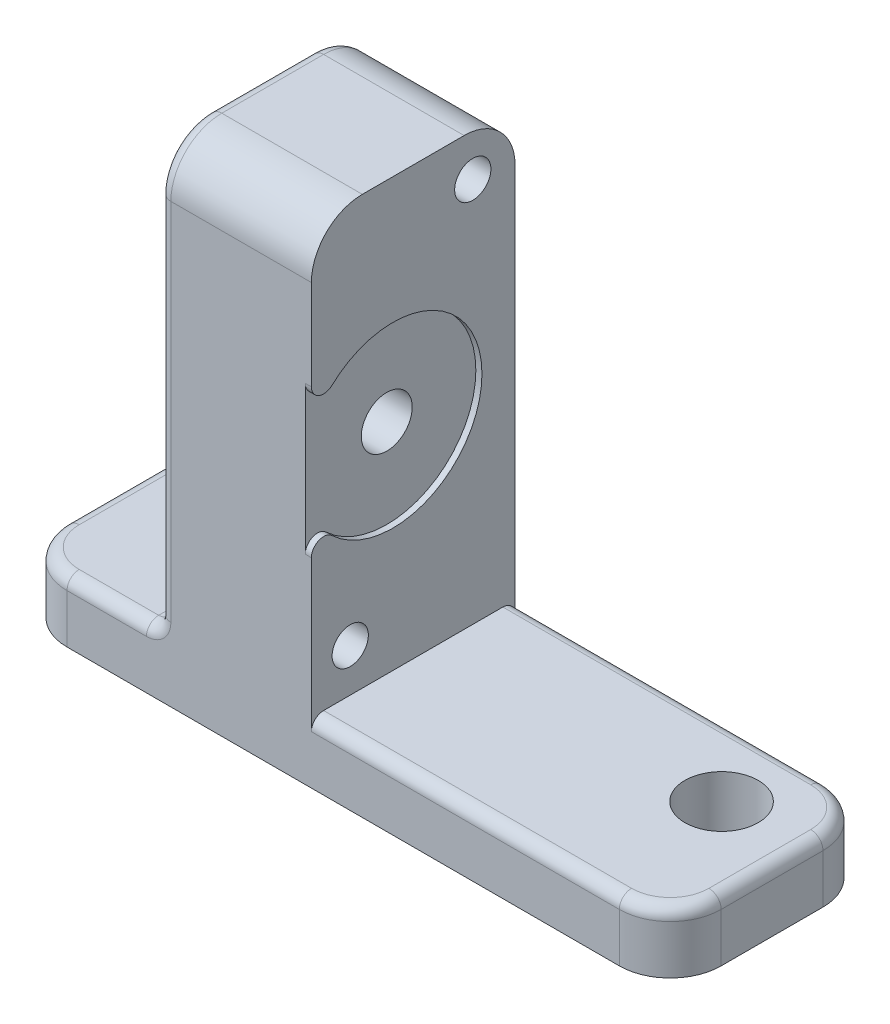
ISO-10303-21;
HEADER;
FILE_DESCRIPTION(('STEP AP214'),'2;1');
FILE_NAME('part.step','',(''),(''),'','','');
FILE_SCHEMA(('AUTOMOTIVE_DESIGN { 1 0 10303 214 1 1 1 1 }'));
ENDSEC;
DATA;
#1=APPLICATION_CONTEXT('core data for automotive mechanical design processes');
#2=APPLICATION_PROTOCOL_DEFINITION('international standard','automotive_design',2000,#1);
#3=PRODUCT_CONTEXT('',#1,'mechanical');
#4=PRODUCT('Part','Part','',(#3));
#5=PRODUCT_RELATED_PRODUCT_CATEGORY('part','',(#4));
#6=PRODUCT_DEFINITION_FORMATION('','',#4);
#7=PRODUCT_DEFINITION_CONTEXT('part definition',#1,'design');
#8=PRODUCT_DEFINITION('design','',#6,#7);
#9=PRODUCT_DEFINITION_SHAPE('','',#8);
#10=(LENGTH_UNIT() NAMED_UNIT(*) SI_UNIT(.MILLI.,.METRE.));
#11=(NAMED_UNIT(*) PLANE_ANGLE_UNIT() SI_UNIT($,.RADIAN.));
#12=(NAMED_UNIT(*) SI_UNIT($,.STERADIAN.) SOLID_ANGLE_UNIT());
#13=UNCERTAINTY_MEASURE_WITH_UNIT(LENGTH_MEASURE(1.E-05),#10,'distance_accuracy_value','');
#14=(GEOMETRIC_REPRESENTATION_CONTEXT(3) GLOBAL_UNCERTAINTY_ASSIGNED_CONTEXT((#13)) GLOBAL_UNIT_ASSIGNED_CONTEXT((#10,
#11,#12)) REPRESENTATION_CONTEXT('',''));
#15=CARTESIAN_POINT('',(0.,0.,0.));
#16=DIRECTION('',(0.,0.,1.));
#17=DIRECTION('',(1.,0.,0.));
#18=AXIS2_PLACEMENT_3D('',#15,#16,#17);
#19=CARTESIAN_POINT('',(-20.3962,3.81,-7.62));
#20=DIRECTION('',(-1.,0.,0.));
#21=DIRECTION('',(0.,0.,1.));
#22=AXIS2_PLACEMENT_3D('',#19,#20,#21);
#23=PLANE('',#22);
#24=DIRECTION('',(0.,-1.,0.));
#25=VECTOR('',#24,1.);
#26=CARTESIAN_POINT('',(-20.3962,3.81,1.905));
#27=LINE('',#26,#25);
#28=CARTESIAN_POINT('',(-20.3962,0.,1.905));
#29=VERTEX_POINT('',#28);
#30=CARTESIAN_POINT('',(-20.3962,3.048,1.905));
#31=VERTEX_POINT('',#30);
#32=EDGE_CURVE('E249',#29,#31,#27,.F.);
#33=ORIENTED_EDGE('',*,*,#32,.T.);
#34=DIRECTION('',(0.,0.,1.));
#35=VECTOR('',#34,1.);
#36=CARTESIAN_POINT('',(-20.3962,3.048,-7.62));
#37=LINE('',#36,#35);
#38=CARTESIAN_POINT('',(-20.3962,3.048,-4.445));
#39=VERTEX_POINT('',#38);
#40=EDGE_CURVE('E246',#31,#39,#37,.F.);
#41=ORIENTED_EDGE('',*,*,#40,.T.);
#42=DIRECTION('',(0.,-1.,0.));
#43=VECTOR('',#42,1.);
#44=CARTESIAN_POINT('',(-20.3962,0.,-4.445));
#45=LINE('',#44,#43);
#46=CARTESIAN_POINT('',(-20.3962,0.,-4.445));
#47=VERTEX_POINT('',#46);
#48=EDGE_CURVE('E239',#39,#47,#45,.T.);
#49=ORIENTED_EDGE('',*,*,#48,.T.);
#50=DIRECTION('',(0.,0.,1.));
#51=VECTOR('',#50,1.);
#52=CARTESIAN_POINT('',(-20.3962,0.,-7.62));
#53=LINE('',#52,#51);
#54=EDGE_CURVE('E243',#47,#29,#53,.T.);
#55=ORIENTED_EDGE('',*,*,#54,.T.);
#56=EDGE_LOOP('',(#33,#41,#49,#55));
#57=FACE_BOUND('',#56,.T.);
#58=ADVANCED_FACE('F50',(#57),#23,.T.);
#59=CARTESIAN_POINT('',(-11.5062,3.81,-7.62));
#60=DIRECTION('',(0.,1.,0.));
#61=DIRECTION('',(-1.,0.,0.));
#62=AXIS2_PLACEMENT_3D('',#59,#60,#61);
#63=PLANE('',#62);
#64=CARTESIAN_POINT('',(-17.2212,3.81,-4.445));
#65=DIRECTION('',(0.,1.,0.));
#66=DIRECTION('',(-1.,0.,0.));
#67=AXIS2_PLACEMENT_3D('',#64,#65,#66);
#68=CIRCLE('',#67,2.413);
#69=CARTESIAN_POINT('',(-17.2212,3.81,-6.858));
#70=VERTEX_POINT('',#69);
#71=CARTESIAN_POINT('',(-19.6342,3.81,-4.445));
#72=VERTEX_POINT('',#71);
#73=EDGE_CURVE('E325',#70,#72,#68,.T.);
#74=ORIENTED_EDGE('',*,*,#73,.T.);
#75=DIRECTION('',(0.,0.,1.));
#76=VECTOR('',#75,1.);
#77=CARTESIAN_POINT('',(-19.6342,3.81,-7.62));
#78=LINE('',#77,#76);
#79=CARTESIAN_POINT('',(-19.6342,3.81,1.905));
#80=VERTEX_POINT('',#79);
#81=EDGE_CURVE('E329',#72,#80,#78,.T.);
#82=ORIENTED_EDGE('',*,*,#81,.T.);
#83=CARTESIAN_POINT('',(-17.2212,3.81,1.905));
#84=DIRECTION('',(0.,1.,0.));
#85=DIRECTION('',(-1.,0.,0.));
#86=AXIS2_PLACEMENT_3D('',#83,#84,#85);
#87=CIRCLE('',#86,2.413);
#88=CARTESIAN_POINT('',(-17.2212,3.81,4.318));
#89=VERTEX_POINT('',#88);
#90=EDGE_CURVE('E327',#80,#89,#87,.T.);
#91=ORIENTED_EDGE('',*,*,#90,.T.);
#92=DIRECTION('',(-1.,0.,0.));
#93=VECTOR('',#92,1.);
#94=CARTESIAN_POINT('',(-11.5062,3.81,4.318));
#95=LINE('',#94,#93);
#96=CARTESIAN_POINT('',(-12.2682,3.81,4.318));
#97=VERTEX_POINT('',#96);
#98=EDGE_CURVE('E323',#89,#97,#95,.F.);
#99=ORIENTED_EDGE('',*,*,#98,.T.);
#100=DIRECTION('',(0.,0.,1.));
#101=VECTOR('',#100,1.);
#102=CARTESIAN_POINT('',(-12.2682,3.81,-7.62));
#103=LINE('',#102,#101);
#104=CARTESIAN_POINT('',(-12.2682,3.81,-6.858));
#105=VERTEX_POINT('',#104);
#106=EDGE_CURVE('E314',#97,#105,#103,.F.);
#107=ORIENTED_EDGE('',*,*,#106,.T.);
#108=DIRECTION('',(-1.,0.,0.));
#109=VECTOR('',#108,1.);
#110=CARTESIAN_POINT('',(-17.2212,3.81,-6.858));
#111=LINE('',#110,#109);
#112=EDGE_CURVE('E321',#105,#70,#111,.T.);
#113=ORIENTED_EDGE('',*,*,#112,.T.);
#114=EDGE_LOOP('',(#74,#82,#91,#99,#107,#113));
#115=FACE_BOUND('',#114,.T.);
#116=CARTESIAN_POINT('',(-15.9004,3.80999999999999,-3.175));
#117=DIRECTION('',(0.,1.,0.));
#118=DIRECTION('',(0.,0.,1.));
#119=AXIS2_PLACEMENT_3D('',#116,#117,#118);
#120=CIRCLE('',#119,2.286);
#121=CARTESIAN_POINT('',(-15.9004,3.80999999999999,-0.888999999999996));
#122=VERTEX_POINT('',#121);
#123=EDGE_CURVE('E525',#122,#122,#120,.T.);
#124=ORIENTED_EDGE('',*,*,#123,.F.);
#125=EDGE_LOOP('',(#124));
#126=FACE_BOUND('',#125,.T.);
#127=ADVANCED_FACE('F552',(#115,#126),#63,.T.);
#128=CARTESIAN_POINT('',(-11.5062,30.48,-7.62));
#129=DIRECTION('',(-1.,0.,0.));
#130=DIRECTION('',(0.,-1.,0.));
#131=AXIS2_PLACEMENT_3D('',#128,#129,#130);
#132=PLANE('',#131);
#133=DIRECTION('',(0.,0.,1.));
#134=VECTOR('',#133,1.);
#135=CARTESIAN_POINT('',(-11.5062,4.572,5.08));
#136=LINE('',#135,#134);
#137=CARTESIAN_POINT('',(-11.5062,4.572,-6.858));
#138=VERTEX_POINT('',#137);
#139=CARTESIAN_POINT('',(-11.5062,4.572,4.318));
#140=VERTEX_POINT('',#139);
#141=EDGE_CURVE('E380',#138,#140,#136,.T.);
#142=ORIENTED_EDGE('',*,*,#141,.T.);
#143=DIRECTION('',(0.,-1.,0.));
#144=VECTOR('',#143,1.);
#145=CARTESIAN_POINT('',(-11.5062,30.48,4.318));
#146=LINE('',#145,#144);
#147=CARTESIAN_POINT('',(-11.5062,27.305,4.318));
#148=VERTEX_POINT('',#147);
#149=EDGE_CURVE('E388',#140,#148,#146,.F.);
#150=ORIENTED_EDGE('',*,*,#149,.T.);
#151=CARTESIAN_POINT('',(-11.5062,27.305,1.905));
#152=DIRECTION('',(-1.,0.,0.));
#153=DIRECTION('',(0.,-1.,0.));
#154=AXIS2_PLACEMENT_3D('',#151,#152,#153);
#155=CIRCLE('',#154,2.413);
#156=CARTESIAN_POINT('',(-11.5062,29.718,1.905));
#157=VERTEX_POINT('',#156);
#158=EDGE_CURVE('E386',#148,#157,#155,.T.);
#159=ORIENTED_EDGE('',*,*,#158,.T.);
#160=DIRECTION('',(0.,0.,1.));
#161=VECTOR('',#160,1.);
#162=CARTESIAN_POINT('',(-11.5062,29.718,-7.62));
#163=LINE('',#162,#161);
#164=CARTESIAN_POINT('',(-11.5062,29.718,-4.445));
#165=VERTEX_POINT('',#164);
#166=EDGE_CURVE('E384',#157,#165,#163,.F.);
#167=ORIENTED_EDGE('',*,*,#166,.T.);
#168=CARTESIAN_POINT('',(-11.5062,27.305,-4.445));
#169=DIRECTION('',(-1.,0.,0.));
#170=DIRECTION('',(0.,-1.,0.));
#171=AXIS2_PLACEMENT_3D('',#168,#169,#170);
#172=CIRCLE('',#171,2.413);
#173=CARTESIAN_POINT('',(-11.5062,27.305,-6.858));
#174=VERTEX_POINT('',#173);
#175=EDGE_CURVE('E382',#165,#174,#172,.T.);
#176=ORIENTED_EDGE('',*,*,#175,.T.);
#177=DIRECTION('',(0.,-1.,0.));
#178=VECTOR('',#177,1.);
#179=CARTESIAN_POINT('',(-11.5062,3.81,-6.858));
#180=LINE('',#179,#178);
#181=EDGE_CURVE('E378',#174,#138,#180,.T.);
#182=ORIENTED_EDGE('',*,*,#181,.T.);
#183=EDGE_LOOP('',(#142,#150,#159,#167,#176,#182));
#184=FACE_BOUND('',#183,.T.);
#185=CARTESIAN_POINT('',(-11.5062,27.8438153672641,-4.98381536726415));
#186=DIRECTION('',(-1.,0.,0.));
#187=DIRECTION('',(0.,0.,1.));
#188=AXIS2_PLACEMENT_3D('',#185,#186,#187);
#189=CIRCLE('',#188,1.13029999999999);
#190=CARTESIAN_POINT('',(-11.5062,27.8438153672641,-3.85351536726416));
#191=VERTEX_POINT('',#190);
#192=EDGE_CURVE('E450',#191,#191,#189,.T.);
#193=ORIENTED_EDGE('',*,*,#192,.F.);
#194=EDGE_LOOP('',(#193));
#195=FACE_BOUND('',#194,.T.);
#196=CARTESIAN_POINT('',(-11.5062,6.48544664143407,2.65855335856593));
#197=DIRECTION('',(-1.,0.,0.));
#198=DIRECTION('',(0.,0.,1.));
#199=AXIS2_PLACEMENT_3D('',#196,#197,#198);
#200=CIRCLE('',#199,1.13029999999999);
#201=CARTESIAN_POINT('',(-11.5062,6.48544664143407,3.78885335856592));
#202=VERTEX_POINT('',#201);
#203=EDGE_CURVE('E319',#202,#202,#200,.T.);
#204=ORIENTED_EDGE('',*,*,#203,.F.);
#205=EDGE_LOOP('',(#204));
#206=FACE_BOUND('',#205,.T.);
#207=CARTESIAN_POINT('',(-11.5062,17.054916,0.));
#208=DIRECTION('',(-1.,0.,0.));
#209=DIRECTION('',(0.,0.,1.));
#210=AXIS2_PLACEMENT_3D('',#207,#208,#209);
#211=CIRCLE('',#210,1.13029999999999);
#212=CARTESIAN_POINT('',(-11.5062,17.054916,1.13029999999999));
#213=VERTEX_POINT('',#212);
#214=EDGE_CURVE('E318',#213,#213,#211,.T.);
#215=ORIENTED_EDGE('',*,*,#214,.F.);
#216=EDGE_LOOP('',(#215));
#217=FACE_BOUND('',#216,.T.);
#218=ADVANCED_FACE('F548',(#184,#195,#206,#217),#132,.T.);
#219=CARTESIAN_POINT('',(-1.9812,30.48,-7.62));
#220=DIRECTION('',(0.,1.,0.));
#221=DIRECTION('',(-1.,0.,0.));
#222=AXIS2_PLACEMENT_3D('',#219,#220,#221);
#223=PLANE('',#222);
#224=DIRECTION('',(-1.,0.,0.));
#225=VECTOR('',#224,1.);
#226=CARTESIAN_POINT('',(-11.5062,30.48,-4.445));
#227=LINE('',#226,#225);
#228=CARTESIAN_POINT('',(-1.9812,30.48,-4.445));
#229=VERTEX_POINT('',#228);
#230=CARTESIAN_POINT('',(-10.7442,30.48,-4.445));
#231=VERTEX_POINT('',#230);
#232=EDGE_CURVE('E306',#229,#231,#227,.T.);
#233=ORIENTED_EDGE('',*,*,#232,.T.);
#234=DIRECTION('',(0.,0.,1.));
#235=VECTOR('',#234,1.);
#236=CARTESIAN_POINT('',(-10.7442,30.48,-7.62));
#237=LINE('',#236,#235);
#238=CARTESIAN_POINT('',(-10.7442,30.48,1.905));
#239=VERTEX_POINT('',#238);
#240=EDGE_CURVE('E393',#231,#239,#237,.T.);
#241=ORIENTED_EDGE('',*,*,#240,.T.);
#242=DIRECTION('',(-1.,0.,0.));
#243=VECTOR('',#242,1.);
#244=CARTESIAN_POINT('',(-1.9812,30.48,1.905));
#245=LINE('',#244,#243);
#246=CARTESIAN_POINT('',(-1.9812,30.48,1.905));
#247=VERTEX_POINT('',#246);
#248=EDGE_CURVE('E304',#239,#247,#245,.F.);
#249=ORIENTED_EDGE('',*,*,#248,.T.);
#250=DIRECTION('',(0.,0.,1.));
#251=VECTOR('',#250,1.);
#252=CARTESIAN_POINT('',(-1.9812,30.48,-7.62));
#253=LINE('',#252,#251);
#254=EDGE_CURVE('E281',#229,#247,#253,.T.);
#255=ORIENTED_EDGE('',*,*,#254,.F.);
#256=EDGE_LOOP('',(#233,#241,#249,#255));
#257=FACE_BOUND('',#256,.T.);
#258=ADVANCED_FACE('F551',(#257),#223,.T.);
#259=CARTESIAN_POINT('',(-1.9812,3.81,-7.62));
#260=DIRECTION('',(1.,0.,0.));
#261=DIRECTION('',(0.,1.,0.));
#262=AXIS2_PLACEMENT_3D('',#259,#260,#261);
#263=PLANE('',#262);
#264=CARTESIAN_POINT('',(-1.9812,27.8438153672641,-4.98381536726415));
#265=DIRECTION('',(1.,0.,0.));
#266=DIRECTION('',(0.,1.,0.));
#267=AXIS2_PLACEMENT_3D('',#264,#265,#266);
#268=CIRCLE('',#267,1.13029999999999);
#269=CARTESIAN_POINT('',(-1.9812,28.9741153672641,-4.98381536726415));
#270=VERTEX_POINT('',#269);
#271=EDGE_CURVE('E540',#270,#270,#268,.T.);
#272=ORIENTED_EDGE('',*,*,#271,.F.);
#273=EDGE_LOOP('',(#272));
#274=FACE_BOUND('',#273,.T.);
#275=CARTESIAN_POINT('',(-1.9812,6.48544664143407,2.65855335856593));
#276=DIRECTION('',(1.,0.,0.));
#277=DIRECTION('',(0.,1.,0.));
#278=AXIS2_PLACEMENT_3D('',#275,#276,#277);
#279=CIRCLE('',#278,1.13029999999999);
#280=CARTESIAN_POINT('',(-1.9812,7.61574664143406,2.65855335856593));
#281=VERTEX_POINT('',#280);
#282=EDGE_CURVE('E315',#281,#281,#279,.T.);
#283=ORIENTED_EDGE('',*,*,#282,.F.);
#284=EDGE_LOOP('',(#283));
#285=FACE_BOUND('',#284,.T.);
#286=DIRECTION('',(0.,1.,0.));
#287=VECTOR('',#286,1.);
#288=CARTESIAN_POINT('',(-1.9812,3.81,5.08));
#289=LINE('',#288,#287);
#290=CARTESIAN_POINT('',(-1.9812,21.667416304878,5.08));
#291=VERTEX_POINT('',#290);
#292=CARTESIAN_POINT('',(-1.9812,27.305,5.08));
#293=VERTEX_POINT('',#292);
#294=EDGE_CURVE('E511',#291,#293,#289,.T.);
#295=ORIENTED_EDGE('',*,*,#294,.F.);
#296=CARTESIAN_POINT('',(-1.9812,21.667416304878,4.318));
#297=DIRECTION('',(1.,0.,0.));
#298=DIRECTION('',(0.,1.,0.));
#299=AXIS2_PLACEMENT_3D('',#296,#297,#298);
#300=CIRCLE('',#299,0.762);
#301=CARTESIAN_POINT('',(-1.9812,21.1111348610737,3.79723618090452));
#302=VERTEX_POINT('',#301);
#303=EDGE_CURVE('E404',#291,#302,#300,.T.);
#304=ORIENTED_EDGE('',*,*,#303,.T.);
#305=CARTESIAN_POINT('',(-1.9812,17.054916,0.));
#306=DIRECTION('',(1.,0.,0.));
#307=DIRECTION('',(0.,0.,-1.));
#308=AXIS2_PLACEMENT_3D('',#305,#306,#307);
#309=CIRCLE('',#308,5.55625);
#310=CARTESIAN_POINT('',(-1.9812,12.9986971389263,3.79723618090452));
#311=VERTEX_POINT('',#310);
#312=EDGE_CURVE('E529',#311,#302,#309,.T.);
#313=ORIENTED_EDGE('',*,*,#312,.F.);
#314=CARTESIAN_POINT('',(-1.9812,12.442415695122,4.318));
#315=DIRECTION('',(1.,0.,0.));
#316=DIRECTION('',(0.,1.,0.));
#317=AXIS2_PLACEMENT_3D('',#314,#315,#316);
#318=CIRCLE('',#317,0.762);
#319=CARTESIAN_POINT('',(-1.9812,12.442415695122,5.08));
#320=VERTEX_POINT('',#319);
#321=EDGE_CURVE('E402',#311,#320,#318,.T.);
#322=ORIENTED_EDGE('',*,*,#321,.T.);
#323=CARTESIAN_POINT('',(-1.9812,3.048,5.08));
#324=VERTEX_POINT('',#323);
#325=EDGE_CURVE('E476',#324,#320,#289,.T.);
#326=ORIENTED_EDGE('',*,*,#325,.F.);
#327=CARTESIAN_POINT('',(-1.9812,3.048,4.318));
#328=DIRECTION('',(1.,0.,0.));
#329=DIRECTION('',(0.,1.,0.));
#330=AXIS2_PLACEMENT_3D('',#327,#328,#329);
#331=CIRCLE('',#330,0.762);
#332=CARTESIAN_POINT('',(-1.9812,3.81,4.318));
#333=VERTEX_POINT('',#332);
#334=EDGE_CURVE('E13',#324,#333,#331,.F.);
#335=ORIENTED_EDGE('',*,*,#334,.T.);
#336=DIRECTION('',(0.,0.,1.));
#337=VECTOR('',#336,1.);
#338=CARTESIAN_POINT('',(-1.9812,3.81,-7.62));
#339=LINE('',#338,#337);
#340=CARTESIAN_POINT('',(-1.9812,3.81,-6.858));
#341=VERTEX_POINT('',#340);
#342=EDGE_CURVE('E269',#341,#333,#339,.T.);
#343=ORIENTED_EDGE('',*,*,#342,.F.);
#344=CARTESIAN_POINT('',(-1.9812,3.048,-6.858));
#345=DIRECTION('',(1.,0.,0.));
#346=DIRECTION('',(0.,1.,0.));
#347=AXIS2_PLACEMENT_3D('',#344,#345,#346);
#348=CIRCLE('',#347,0.762);
#349=CARTESIAN_POINT('',(-1.9812,3.048,-7.62));
#350=VERTEX_POINT('',#349);
#351=EDGE_CURVE('E406',#341,#350,#348,.F.);
#352=ORIENTED_EDGE('',*,*,#351,.T.);
#353=DIRECTION('',(0.,1.,0.));
#354=VECTOR('',#353,1.);
#355=CARTESIAN_POINT('',(-1.9812,3.81,-7.62));
#356=LINE('',#355,#354);
#357=CARTESIAN_POINT('',(-1.9812,27.305,-7.62));
#358=VERTEX_POINT('',#357);
#359=EDGE_CURVE('E266',#350,#358,#356,.T.);
#360=ORIENTED_EDGE('',*,*,#359,.T.);
#361=CARTESIAN_POINT('',(-1.9812,27.305,-4.445));
#362=DIRECTION('',(1.,0.,0.));
#363=DIRECTION('',(0.,1.,0.));
#364=AXIS2_PLACEMENT_3D('',#361,#362,#363);
#365=CIRCLE('',#364,3.175);
#366=EDGE_CURVE('E312',#358,#229,#365,.T.);
#367=ORIENTED_EDGE('',*,*,#366,.T.);
#368=ORIENTED_EDGE('',*,*,#254,.T.);
#369=CARTESIAN_POINT('',(-1.9812,27.305,1.905));
#370=DIRECTION('',(1.,0.,0.));
#371=DIRECTION('',(0.,1.,0.));
#372=AXIS2_PLACEMENT_3D('',#369,#370,#371);
#373=CIRCLE('',#372,3.175);
#374=EDGE_CURVE('E309',#247,#293,#373,.T.);
#375=ORIENTED_EDGE('',*,*,#374,.T.);
#376=EDGE_LOOP('',(#295,#304,#313,#322,#326,#335,#343,#352,#360,#367,#368,#375));
#377=FACE_BOUND('',#376,.T.);
#378=ADVANCED_FACE('F692',(#274,#285,#377),#263,.T.);
#379=CARTESIAN_POINT('',(20.3962,3.81,-7.62));
#380=DIRECTION('',(0.,1.,0.));
#381=DIRECTION('',(-1.,0.,0.));
#382=AXIS2_PLACEMENT_3D('',#379,#380,#381);
#383=PLANE('',#382);
#384=CARTESIAN_POINT('',(15.3416,3.81,-3.175));
#385=DIRECTION('',(0.,1.,0.));
#386=DIRECTION('',(0.,0.,1.));
#387=AXIS2_PLACEMENT_3D('',#384,#385,#386);
#388=CIRCLE('',#387,2.286);
#389=CARTESIAN_POINT('',(15.3416,3.81,-0.888999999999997));
#390=VERTEX_POINT('',#389);
#391=EDGE_CURVE('E519',#390,#390,#388,.T.);
#392=ORIENTED_EDGE('',*,*,#391,.F.);
#393=EDGE_LOOP('',(#392));
#394=FACE_BOUND('',#393,.T.);
#395=CARTESIAN_POINT('',(17.2212,3.81,-4.445));
#396=DIRECTION('',(0.,1.,0.));
#397=DIRECTION('',(-1.,0.,0.));
#398=AXIS2_PLACEMENT_3D('',#395,#396,#397);
#399=CIRCLE('',#398,2.413);
#400=CARTESIAN_POINT('',(19.6342,3.81,-4.445));
#401=VERTEX_POINT('',#400);
#402=CARTESIAN_POINT('',(17.2212,3.81,-6.858));
#403=VERTEX_POINT('',#402);
#404=EDGE_CURVE('E367',#401,#403,#399,.T.);
#405=ORIENTED_EDGE('',*,*,#404,.T.);
#406=DIRECTION('',(-1.,0.,0.));
#407=VECTOR('',#406,1.);
#408=CARTESIAN_POINT('',(-1.9812,3.81,-6.858));
#409=LINE('',#408,#407);
#410=EDGE_CURVE('E369',#403,#341,#409,.T.);
#411=ORIENTED_EDGE('',*,*,#410,.T.);
#412=ORIENTED_EDGE('',*,*,#342,.T.);
#413=DIRECTION('',(-1.,0.,0.));
#414=VECTOR('',#413,1.);
#415=CARTESIAN_POINT('',(20.3962,3.81,4.318));
#416=LINE('',#415,#414);
#417=CARTESIAN_POINT('',(17.2212,3.81,4.318));
#418=VERTEX_POINT('',#417);
#419=EDGE_CURVE('E361',#333,#418,#416,.F.);
#420=ORIENTED_EDGE('',*,*,#419,.T.);
#421=CARTESIAN_POINT('',(17.2212,3.81,1.905));
#422=DIRECTION('',(0.,1.,0.));
#423=DIRECTION('',(-1.,0.,0.));
#424=AXIS2_PLACEMENT_3D('',#421,#422,#423);
#425=CIRCLE('',#424,2.413);
#426=CARTESIAN_POINT('',(19.6342,3.81,1.905));
#427=VERTEX_POINT('',#426);
#428=EDGE_CURVE('E363',#418,#427,#425,.T.);
#429=ORIENTED_EDGE('',*,*,#428,.T.);
#430=DIRECTION('',(0.,0.,1.));
#431=VECTOR('',#430,1.);
#432=CARTESIAN_POINT('',(19.6342,3.81,-7.62));
#433=LINE('',#432,#431);
#434=EDGE_CURVE('E365',#427,#401,#433,.F.);
#435=ORIENTED_EDGE('',*,*,#434,.T.);
#436=EDGE_LOOP('',(#405,#411,#412,#420,#429,#435));
#437=FACE_BOUND('',#436,.T.);
#438=ADVANCED_FACE('F502',(#394,#437),#383,.T.);
#439=CARTESIAN_POINT('',(20.3962,3.81,-7.62));
#440=DIRECTION('',(1.,0.,0.));
#441=DIRECTION('',(0.,0.,-1.));
#442=AXIS2_PLACEMENT_3D('',#439,#440,#441);
#443=PLANE('',#442);
#444=DIRECTION('',(0.,1.,0.));
#445=VECTOR('',#444,1.);
#446=CARTESIAN_POINT('',(20.3962,3.81,-4.445));
#447=LINE('',#446,#445);
#448=CARTESIAN_POINT('',(20.3962,0.,-4.445));
#449=VERTEX_POINT('',#448);
#450=CARTESIAN_POINT('',(20.3962,3.048,-4.445));
#451=VERTEX_POINT('',#450);
#452=EDGE_CURVE('E293',#449,#451,#447,.T.);
#453=ORIENTED_EDGE('',*,*,#452,.T.);
#454=DIRECTION('',(0.,0.,1.));
#455=VECTOR('',#454,1.);
#456=CARTESIAN_POINT('',(20.3962,3.048,-7.62));
#457=LINE('',#456,#455);
#458=CARTESIAN_POINT('',(20.3962,3.048,1.905));
#459=VERTEX_POINT('',#458);
#460=EDGE_CURVE('E374',#451,#459,#457,.T.);
#461=ORIENTED_EDGE('',*,*,#460,.T.);
#462=DIRECTION('',(0.,1.,0.));
#463=VECTOR('',#462,1.);
#464=CARTESIAN_POINT('',(20.3962,3.81,1.905));
#465=LINE('',#464,#463);
#466=CARTESIAN_POINT('',(20.3962,0.,1.905));
#467=VERTEX_POINT('',#466);
#468=EDGE_CURVE('E291',#459,#467,#465,.F.);
#469=ORIENTED_EDGE('',*,*,#468,.T.);
#470=DIRECTION('',(0.,0.,1.));
#471=VECTOR('',#470,1.);
#472=CARTESIAN_POINT('',(20.3962,0.,-7.62));
#473=LINE('',#472,#471);
#474=EDGE_CURVE('E265',#449,#467,#473,.T.);
#475=ORIENTED_EDGE('',*,*,#474,.F.);
#476=EDGE_LOOP('',(#453,#461,#469,#475));
#477=FACE_BOUND('',#476,.T.);
#478=ADVANCED_FACE('F487',(#477),#443,.T.);
#479=CARTESIAN_POINT('',(-20.3962,0.,-7.62));
#480=DIRECTION('',(0.,-1.,0.));
#481=DIRECTION('',(0.,0.,-1.));
#482=AXIS2_PLACEMENT_3D('',#479,#480,#481);
#483=PLANE('',#482);
#484=CARTESIAN_POINT('',(-15.9004,0.,-3.175));
#485=DIRECTION('',(0.,1.,0.));
#486=DIRECTION('',(0.,0.,1.));
#487=AXIS2_PLACEMENT_3D('',#484,#485,#486);
#488=CIRCLE('',#487,2.286);
#489=CARTESIAN_POINT('',(-15.9004,0.,-0.888999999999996));
#490=VERTEX_POINT('',#489);
#491=EDGE_CURVE('E522',#490,#490,#488,.T.);
#492=ORIENTED_EDGE('',*,*,#491,.T.);
#493=EDGE_LOOP('',(#492));
#494=FACE_BOUND('',#493,.T.);
#495=CARTESIAN_POINT('',(15.3416,0.,-3.175));
#496=DIRECTION('',(0.,1.,0.));
#497=DIRECTION('',(0.,0.,1.));
#498=AXIS2_PLACEMENT_3D('',#495,#496,#497);
#499=CIRCLE('',#498,2.286);
#500=CARTESIAN_POINT('',(15.3416,0.,-0.888999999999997));
#501=VERTEX_POINT('',#500);
#502=EDGE_CURVE('E516',#501,#501,#499,.T.);
#503=ORIENTED_EDGE('',*,*,#502,.T.);
#504=EDGE_LOOP('',(#503));
#505=FACE_BOUND('',#504,.T.);
#506=ORIENTED_EDGE('',*,*,#54,.F.);
#507=CARTESIAN_POINT('',(-17.2212,0.,-4.445));
#508=DIRECTION('',(0.,-1.,0.));
#509=DIRECTION('',(0.,0.,-1.));
#510=AXIS2_PLACEMENT_3D('',#507,#508,#509);
#511=CIRCLE('',#510,3.175);
#512=CARTESIAN_POINT('',(-17.2212,0.,-7.62));
#513=VERTEX_POINT('',#512);
#514=EDGE_CURVE('E252',#47,#513,#511,.T.);
#515=ORIENTED_EDGE('',*,*,#514,.T.);
#516=DIRECTION('',(1.,0.,0.));
#517=VECTOR('',#516,1.);
#518=CARTESIAN_POINT('',(-20.3962,0.,-7.62));
#519=LINE('',#518,#517);
#520=CARTESIAN_POINT('',(17.2212,0.,-7.62));
#521=VERTEX_POINT('',#520);
#522=EDGE_CURVE('E272',#513,#521,#519,.T.);
#523=ORIENTED_EDGE('',*,*,#522,.T.);
#524=CARTESIAN_POINT('',(17.2212,0.,-4.445));
#525=DIRECTION('',(0.,-1.,0.));
#526=DIRECTION('',(0.,0.,-1.));
#527=AXIS2_PLACEMENT_3D('',#524,#525,#526);
#528=CIRCLE('',#527,3.175);
#529=EDGE_CURVE('E260',#521,#449,#528,.T.);
#530=ORIENTED_EDGE('',*,*,#529,.T.);
#531=ORIENTED_EDGE('',*,*,#474,.T.);
#532=CARTESIAN_POINT('',(17.2212,0.,1.905));
#533=DIRECTION('',(0.,-1.,0.));
#534=DIRECTION('',(0.,0.,-1.));
#535=AXIS2_PLACEMENT_3D('',#532,#533,#534);
#536=CIRCLE('',#535,3.175);
#537=CARTESIAN_POINT('',(17.2212,0.,5.08));
#538=VERTEX_POINT('',#537);
#539=EDGE_CURVE('E284',#467,#538,#536,.T.);
#540=ORIENTED_EDGE('',*,*,#539,.T.);
#541=DIRECTION('',(1.,0.,0.));
#542=VECTOR('',#541,1.);
#543=CARTESIAN_POINT('',(-20.3962,0.,5.08));
#544=LINE('',#543,#542);
#545=CARTESIAN_POINT('',(-17.2212,0.,5.08));
#546=VERTEX_POINT('',#545);
#547=EDGE_CURVE('E480',#546,#538,#544,.T.);
#548=ORIENTED_EDGE('',*,*,#547,.F.);
#549=CARTESIAN_POINT('',(-17.2212,0.,1.905));
#550=DIRECTION('',(0.,-1.,0.));
#551=DIRECTION('',(0.,0.,-1.));
#552=AXIS2_PLACEMENT_3D('',#549,#550,#551);
#553=CIRCLE('',#552,3.175);
#554=EDGE_CURVE('E248',#546,#29,#553,.T.);
#555=ORIENTED_EDGE('',*,*,#554,.T.);
#556=EDGE_LOOP('',(#506,#515,#523,#530,#531,#540,#548,#555));
#557=FACE_BOUND('',#556,.T.);
#558=ADVANCED_FACE('F262',(#494,#505,#557),#483,.T.);
#559=CARTESIAN_POINT('',(0.,0.,-7.62));
#560=DIRECTION('',(0.,0.,1.));
#561=DIRECTION('',(1.,0.,0.));
#562=AXIS2_PLACEMENT_3D('',#559,#560,#561);
#563=PLANE('',#562);
#564=ORIENTED_EDGE('',*,*,#359,.F.);
#565=DIRECTION('',(-1.,0.,0.));
#566=VECTOR('',#565,1.);
#567=CARTESIAN_POINT('',(17.2212,3.048,-7.62));
#568=LINE('',#567,#566);
#569=CARTESIAN_POINT('',(17.2212,3.048,-7.62));
#570=VERTEX_POINT('',#569);
#571=EDGE_CURVE('E359',#350,#570,#568,.F.);
#572=ORIENTED_EDGE('',*,*,#571,.T.);
#573=DIRECTION('',(0.,1.,0.));
#574=VECTOR('',#573,1.);
#575=CARTESIAN_POINT('',(17.2212,0.,-7.62));
#576=LINE('',#575,#574);
#577=EDGE_CURVE('E288',#570,#521,#576,.F.);
#578=ORIENTED_EDGE('',*,*,#577,.T.);
#579=ORIENTED_EDGE('',*,*,#522,.F.);
#580=DIRECTION('',(0.,-1.,0.));
#581=VECTOR('',#580,1.);
#582=CARTESIAN_POINT('',(-17.2212,3.81,-7.62));
#583=LINE('',#582,#581);
#584=CARTESIAN_POINT('',(-17.2212,3.048,-7.62));
#585=VERTEX_POINT('',#584);
#586=EDGE_CURVE('E255',#513,#585,#583,.F.);
#587=ORIENTED_EDGE('',*,*,#586,.T.);
#588=DIRECTION('',(-1.,0.,0.));
#589=VECTOR('',#588,1.);
#590=CARTESIAN_POINT('',(-11.5062,3.048,-7.62));
#591=LINE('',#590,#589);
#592=CARTESIAN_POINT('',(-12.2682,3.048,-7.62));
#593=VERTEX_POINT('',#592);
#594=EDGE_CURVE('E357',#585,#593,#591,.F.);
#595=ORIENTED_EDGE('',*,*,#594,.T.);
#596=CARTESIAN_POINT('',(-12.2682,4.572,-7.62));
#597=DIRECTION('',(0.,0.,1.));
#598=DIRECTION('',(1.,0.,0.));
#599=AXIS2_PLACEMENT_3D('',#596,#597,#598);
#600=CIRCLE('',#599,1.524);
#601=CARTESIAN_POINT('',(-10.7442,4.572,-7.62));
#602=VERTEX_POINT('',#601);
#603=EDGE_CURVE('E354',#602,#593,#600,.F.);
#604=ORIENTED_EDGE('',*,*,#603,.F.);
#605=DIRECTION('',(0.,-1.,0.));
#606=VECTOR('',#605,1.);
#607=CARTESIAN_POINT('',(-10.7442,27.305,-7.62));
#608=LINE('',#607,#606);
#609=CARTESIAN_POINT('',(-10.7442,27.305,-7.62));
#610=VERTEX_POINT('',#609);
#611=EDGE_CURVE('E352',#602,#610,#608,.F.);
#612=ORIENTED_EDGE('',*,*,#611,.T.);
#613=DIRECTION('',(-1.,0.,0.));
#614=VECTOR('',#613,1.);
#615=CARTESIAN_POINT('',(-1.9812,27.305,-7.62));
#616=LINE('',#615,#614);
#617=EDGE_CURVE('E259',#610,#358,#616,.F.);
#618=ORIENTED_EDGE('',*,*,#617,.T.);
#619=EDGE_LOOP('',(#564,#572,#578,#579,#587,#595,#604,#612,#618));
#620=FACE_BOUND('',#619,.T.);
#621=ADVANCED_FACE('F721',(#620),#563,.F.);
#622=CARTESIAN_POINT('',(0.,0.,5.08));
#623=DIRECTION('',(0.,0.,1.));
#624=DIRECTION('',(1.,0.,0.));
#625=AXIS2_PLACEMENT_3D('',#622,#623,#624);
#626=PLANE('',#625);
#627=CARTESIAN_POINT('',(-12.2682,4.572,5.08));
#628=DIRECTION('',(0.,0.,1.));
#629=DIRECTION('',(1.,0.,0.));
#630=AXIS2_PLACEMENT_3D('',#627,#628,#629);
#631=CIRCLE('',#630,1.524);
#632=CARTESIAN_POINT('',(-12.2682,3.048,5.08));
#633=VERTEX_POINT('',#632);
#634=CARTESIAN_POINT('',(-10.7442,4.572,5.08));
#635=VERTEX_POINT('',#634);
#636=EDGE_CURVE('E345',#633,#635,#631,.T.);
#637=ORIENTED_EDGE('',*,*,#636,.F.);
#638=DIRECTION('',(-1.,0.,0.));
#639=VECTOR('',#638,1.);
#640=CARTESIAN_POINT('',(0.,3.048,5.08));
#641=LINE('',#640,#639);
#642=CARTESIAN_POINT('',(-17.2212,3.048,5.08));
#643=VERTEX_POINT('',#642);
#644=EDGE_CURVE('E350',#633,#643,#641,.T.);
#645=ORIENTED_EDGE('',*,*,#644,.T.);
#646=DIRECTION('',(0.,-1.,0.));
#647=VECTOR('',#646,1.);
#648=CARTESIAN_POINT('',(-17.2212,0.,5.08));
#649=LINE('',#648,#647);
#650=EDGE_CURVE('E299',#643,#546,#649,.T.);
#651=ORIENTED_EDGE('',*,*,#650,.T.);
#652=ORIENTED_EDGE('',*,*,#547,.T.);
#653=DIRECTION('',(0.,1.,0.));
#654=VECTOR('',#653,1.);
#655=CARTESIAN_POINT('',(17.2212,0.,5.08));
#656=LINE('',#655,#654);
#657=CARTESIAN_POINT('',(17.2212,3.048,5.08));
#658=VERTEX_POINT('',#657);
#659=EDGE_CURVE('E301',#538,#658,#656,.T.);
#660=ORIENTED_EDGE('',*,*,#659,.T.);
#661=DIRECTION('',(-1.,0.,0.));
#662=VECTOR('',#661,1.);
#663=CARTESIAN_POINT('',(0.,3.048,5.08));
#664=LINE('',#663,#662);
#665=EDGE_CURVE('E337',#658,#324,#664,.T.);
#666=ORIENTED_EDGE('',*,*,#665,.T.);
#667=ORIENTED_EDGE('',*,*,#325,.T.);
#668=DIRECTION('',(-1.,0.,0.));
#669=VECTOR('',#668,1.);
#670=CARTESIAN_POINT('',(-2.3622,12.442415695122,5.08));
#671=LINE('',#670,#669);
#672=CARTESIAN_POINT('',(-2.3622,12.442415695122,5.08));
#673=VERTEX_POINT('',#672);
#674=EDGE_CURVE('E340',#320,#673,#671,.T.);
#675=ORIENTED_EDGE('',*,*,#674,.T.);
#676=DIRECTION('',(0.,1.,0.));
#677=VECTOR('',#676,1.);
#678=CARTESIAN_POINT('',(-2.3622,0.,5.08));
#679=LINE('',#678,#677);
#680=CARTESIAN_POINT('',(-2.3622,21.667416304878,5.08));
#681=VERTEX_POINT('',#680);
#682=EDGE_CURVE('E279',#673,#681,#679,.T.);
#683=ORIENTED_EDGE('',*,*,#682,.T.);
#684=DIRECTION('',(-1.,0.,0.));
#685=VECTOR('',#684,1.);
#686=CARTESIAN_POINT('',(-1.9812,21.667416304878,5.08));
#687=LINE('',#686,#685);
#688=EDGE_CURVE('E343',#681,#291,#687,.F.);
#689=ORIENTED_EDGE('',*,*,#688,.T.);
#690=ORIENTED_EDGE('',*,*,#294,.T.);
#691=DIRECTION('',(-1.,0.,0.));
#692=VECTOR('',#691,1.);
#693=CARTESIAN_POINT('',(0.,27.305,5.08));
#694=LINE('',#693,#692);
#695=CARTESIAN_POINT('',(-10.7442,27.305,5.08));
#696=VERTEX_POINT('',#695);
#697=EDGE_CURVE('E296',#293,#696,#694,.T.);
#698=ORIENTED_EDGE('',*,*,#697,.T.);
#699=DIRECTION('',(0.,-1.,0.));
#700=VECTOR('',#699,1.);
#701=CARTESIAN_POINT('',(-10.7442,0.,5.08));
#702=LINE('',#701,#700);
#703=EDGE_CURVE('E348',#696,#635,#702,.T.);
#704=ORIENTED_EDGE('',*,*,#703,.T.);
#705=EDGE_LOOP('',(#637,#645,#651,#652,#660,#666,#667,#675,#683,#689,#690,#698,#704));
#706=FACE_BOUND('',#705,.T.);
#707=ADVANCED_FACE('F475',(#706),#626,.T.);
#708=CARTESIAN_POINT('',(15.3416,3.81,-3.175));
#709=DIRECTION('',(0.,1.,0.));
#710=DIRECTION('',(0.,0.,1.));
#711=AXIS2_PLACEMENT_3D('',#708,#709,#710);
#712=CYLINDRICAL_SURFACE('',#711,2.286);
#713=ORIENTED_EDGE('',*,*,#502,.F.);
#714=EDGE_LOOP('',(#713));
#715=FACE_BOUND('',#714,.T.);
#716=ORIENTED_EDGE('',*,*,#391,.T.);
#717=EDGE_LOOP('',(#716));
#718=FACE_BOUND('',#717,.T.);
#719=ADVANCED_FACE('F590',(#715,#718),#712,.F.);
#720=CARTESIAN_POINT('',(-15.9004,3.80999999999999,-3.175));
#721=DIRECTION('',(0.,1.,0.));
#722=DIRECTION('',(0.,0.,1.));
#723=AXIS2_PLACEMENT_3D('',#720,#721,#722);
#724=CYLINDRICAL_SURFACE('',#723,2.286);
#725=ORIENTED_EDGE('',*,*,#491,.F.);
#726=EDGE_LOOP('',(#725));
#727=FACE_BOUND('',#726,.T.);
#728=ORIENTED_EDGE('',*,*,#123,.T.);
#729=EDGE_LOOP('',(#728));
#730=FACE_BOUND('',#729,.T.);
#731=ADVANCED_FACE('F582',(#727,#730),#724,.F.);
#732=CARTESIAN_POINT('',(-2.3622,17.054916,0.));
#733=DIRECTION('',(1.,0.,0.));
#734=DIRECTION('',(0.,0.,-1.));
#735=AXIS2_PLACEMENT_3D('',#732,#733,#734);
#736=PLANE('',#735);
#737=ORIENTED_EDGE('',*,*,#682,.F.);
#738=CARTESIAN_POINT('',(-2.3622,12.442415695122,4.318));
#739=DIRECTION('',(1.,0.,0.));
#740=DIRECTION('',(0.,0.,-1.));
#741=AXIS2_PLACEMENT_3D('',#738,#739,#740);
#742=CIRCLE('',#741,0.762);
#743=CARTESIAN_POINT('',(-2.3622,12.9986971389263,3.79723618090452));
#744=VERTEX_POINT('',#743);
#745=EDGE_CURVE('E59',#673,#744,#742,.F.);
#746=ORIENTED_EDGE('',*,*,#745,.T.);
#747=CARTESIAN_POINT('',(-2.3622,17.054916,0.));
#748=DIRECTION('',(1.,0.,0.));
#749=DIRECTION('',(0.,0.,-1.));
#750=AXIS2_PLACEMENT_3D('',#747,#748,#749);
#751=CIRCLE('',#750,5.55625);
#752=CARTESIAN_POINT('',(-2.3622,21.1111348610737,3.79723618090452));
#753=VERTEX_POINT('',#752);
#754=EDGE_CURVE('E280',#744,#753,#751,.T.);
#755=ORIENTED_EDGE('',*,*,#754,.T.);
#756=CARTESIAN_POINT('',(-2.3622,21.667416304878,4.318));
#757=DIRECTION('',(1.,0.,0.));
#758=DIRECTION('',(0.,0.,-1.));
#759=AXIS2_PLACEMENT_3D('',#756,#757,#758);
#760=CIRCLE('',#759,0.762);
#761=EDGE_CURVE('E67',#753,#681,#760,.F.);
#762=ORIENTED_EDGE('',*,*,#761,.T.);
#763=EDGE_LOOP('',(#737,#746,#755,#762));
#764=FACE_BOUND('',#763,.T.);
#765=CARTESIAN_POINT('',(-2.3622,17.054916,0.));
#766=DIRECTION('',(1.,0.,0.));
#767=DIRECTION('',(0.,0.,-1.));
#768=AXIS2_PLACEMENT_3D('',#765,#766,#767);
#769=CIRCLE('',#768,1.5875);
#770=CARTESIAN_POINT('',(-2.3622,17.054916,-1.5875));
#771=VERTEX_POINT('',#770);
#772=EDGE_CURVE('E276',#771,#771,#769,.F.);
#773=ORIENTED_EDGE('',*,*,#772,.T.);
#774=EDGE_LOOP('',(#773));
#775=FACE_BOUND('',#774,.T.);
#776=ADVANCED_FACE('F580',(#764,#775),#736,.T.);
#777=CARTESIAN_POINT('',(-2.3622,17.054916,0.));
#778=DIRECTION('',(1.,0.,0.));
#779=DIRECTION('',(0.,0.,-1.));
#780=AXIS2_PLACEMENT_3D('',#777,#778,#779);
#781=CYLINDRICAL_SURFACE('',#780,5.55625);
#782=ORIENTED_EDGE('',*,*,#312,.T.);
#783=DIRECTION('',(1.,0.,0.));
#784=VECTOR('',#783,1.);
#785=CARTESIAN_POINT('',(-2.3622,21.1111348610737,3.79723618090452));
#786=LINE('',#785,#784);
#787=EDGE_CURVE('E400',#302,#753,#786,.F.);
#788=ORIENTED_EDGE('',*,*,#787,.T.);
#789=ORIENTED_EDGE('',*,*,#754,.F.);
#790=DIRECTION('',(1.,0.,0.));
#791=VECTOR('',#790,1.);
#792=CARTESIAN_POINT('',(-2.3622,12.9986971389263,3.79723618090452));
#793=LINE('',#792,#791);
#794=EDGE_CURVE('E397',#744,#311,#793,.T.);
#795=ORIENTED_EDGE('',*,*,#794,.T.);
#796=EDGE_LOOP('',(#782,#788,#789,#795));
#797=FACE_BOUND('',#796,.T.);
#798=ADVANCED_FACE('F571',(#797),#781,.F.);
#799=CARTESIAN_POINT('',(-7.6962,17.054916,0.));
#800=DIRECTION('',(-1.,0.,0.));
#801=DIRECTION('',(0.,0.,1.));
#802=AXIS2_PLACEMENT_3D('',#799,#800,#801);
#803=PLANE('',#802);
#804=CARTESIAN_POINT('',(-7.6962,17.054916,0.));
#805=DIRECTION('',(-1.,0.,0.));
#806=DIRECTION('',(0.,0.,1.));
#807=AXIS2_PLACEMENT_3D('',#804,#805,#806);
#808=CIRCLE('',#807,1.13029999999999);
#809=CARTESIAN_POINT('',(-7.6962,17.054916,1.13029999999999));
#810=VERTEX_POINT('',#809);
#811=EDGE_CURVE('E532',#810,#810,#808,.T.);
#812=ORIENTED_EDGE('',*,*,#811,.T.);
#813=EDGE_LOOP('',(#812));
#814=FACE_BOUND('',#813,.T.);
#815=CARTESIAN_POINT('',(-7.6962,17.054916,0.));
#816=DIRECTION('',(1.,0.,0.));
#817=DIRECTION('',(0.,0.,-1.));
#818=AXIS2_PLACEMENT_3D('',#815,#816,#817);
#819=CIRCLE('',#818,1.5875);
#820=CARTESIAN_POINT('',(-7.6962,17.054916,-1.5875));
#821=VERTEX_POINT('',#820);
#822=EDGE_CURVE('E513',#821,#821,#819,.T.);
#823=ORIENTED_EDGE('',*,*,#822,.T.);
#824=EDGE_LOOP('',(#823));
#825=FACE_BOUND('',#824,.T.);
#826=ADVANCED_FACE('F567',(#814,#825),#803,.F.);
#827=CARTESIAN_POINT('',(-1.9812,17.054916,0.));
#828=DIRECTION('',(1.,0.,0.));
#829=DIRECTION('',(0.,0.,-1.));
#830=AXIS2_PLACEMENT_3D('',#827,#828,#829);
#831=CYLINDRICAL_SURFACE('',#830,1.5875);
#832=ORIENTED_EDGE('',*,*,#822,.F.);
#833=EDGE_LOOP('',(#832));
#834=FACE_BOUND('',#833,.T.);
#835=ORIENTED_EDGE('',*,*,#772,.F.);
#836=EDGE_LOOP('',(#835));
#837=FACE_BOUND('',#836,.T.);
#838=ADVANCED_FACE('F570',(#834,#837),#831,.F.);
#839=CARTESIAN_POINT('',(-17.2212,3.81,-4.445));
#840=DIRECTION('',(0.,1.,0.));
#841=DIRECTION('',(0.,0.,1.));
#842=AXIS2_PLACEMENT_3D('',#839,#840,#841);
#843=CYLINDRICAL_SURFACE('',#842,3.175);
#844=ORIENTED_EDGE('',*,*,#48,.F.);
#845=CARTESIAN_POINT('',(-17.2212,3.048,-4.445));
#846=DIRECTION('',(0.,1.,0.));
#847=DIRECTION('',(-1.,0.,0.));
#848=AXIS2_PLACEMENT_3D('',#845,#846,#847);
#849=CIRCLE('',#848,3.175);
#850=EDGE_CURVE('E335',#39,#585,#849,.F.);
#851=ORIENTED_EDGE('',*,*,#850,.T.);
#852=ORIENTED_EDGE('',*,*,#586,.F.);
#853=ORIENTED_EDGE('',*,*,#514,.F.);
#854=EDGE_LOOP('',(#844,#851,#852,#853));
#855=FACE_BOUND('',#854,.T.);
#856=ADVANCED_FACE('F253',(#855),#843,.T.);
#857=CARTESIAN_POINT('',(17.2212,3.81,-4.445));
#858=DIRECTION('',(0.,-1.,0.));
#859=DIRECTION('',(0.,0.,-1.));
#860=AXIS2_PLACEMENT_3D('',#857,#858,#859);
#861=CYLINDRICAL_SURFACE('',#860,3.175);
#862=ORIENTED_EDGE('',*,*,#577,.F.);
#863=CARTESIAN_POINT('',(17.2212,3.048,-4.445));
#864=DIRECTION('',(0.,1.,0.));
#865=DIRECTION('',(-1.,0.,0.));
#866=AXIS2_PLACEMENT_3D('',#863,#864,#865);
#867=CIRCLE('',#866,3.175);
#868=EDGE_CURVE('E372',#570,#451,#867,.F.);
#869=ORIENTED_EDGE('',*,*,#868,.T.);
#870=ORIENTED_EDGE('',*,*,#452,.F.);
#871=ORIENTED_EDGE('',*,*,#529,.F.);
#872=EDGE_LOOP('',(#862,#869,#870,#871));
#873=FACE_BOUND('',#872,.T.);
#874=ADVANCED_FACE('F492',(#873),#861,.T.);
#875=CARTESIAN_POINT('',(17.2212,0.,1.905));
#876=DIRECTION('',(0.,1.,0.));
#877=DIRECTION('',(0.,0.,1.));
#878=AXIS2_PLACEMENT_3D('',#875,#876,#877);
#879=CYLINDRICAL_SURFACE('',#878,3.175);
#880=ORIENTED_EDGE('',*,*,#468,.F.);
#881=CARTESIAN_POINT('',(17.2212,3.048,1.905));
#882=DIRECTION('',(0.,1.,0.));
#883=DIRECTION('',(-1.,0.,0.));
#884=AXIS2_PLACEMENT_3D('',#881,#882,#883);
#885=CIRCLE('',#884,3.175);
#886=EDGE_CURVE('E376',#459,#658,#885,.F.);
#887=ORIENTED_EDGE('',*,*,#886,.T.);
#888=ORIENTED_EDGE('',*,*,#659,.F.);
#889=ORIENTED_EDGE('',*,*,#539,.F.);
#890=EDGE_LOOP('',(#880,#887,#888,#889));
#891=FACE_BOUND('',#890,.T.);
#892=ADVANCED_FACE('F484',(#891),#879,.T.);
#893=CARTESIAN_POINT('',(-17.2212,0.,1.905));
#894=DIRECTION('',(0.,-1.,0.));
#895=DIRECTION('',(0.,0.,-1.));
#896=AXIS2_PLACEMENT_3D('',#893,#894,#895);
#897=CYLINDRICAL_SURFACE('',#896,3.175);
#898=ORIENTED_EDGE('',*,*,#650,.F.);
#899=CARTESIAN_POINT('',(-17.2212,3.048,1.905));
#900=DIRECTION('',(0.,1.,0.));
#901=DIRECTION('',(-1.,0.,0.));
#902=AXIS2_PLACEMENT_3D('',#899,#900,#901);
#903=CIRCLE('',#902,3.175);
#904=EDGE_CURVE('E333',#643,#31,#903,.F.);
#905=ORIENTED_EDGE('',*,*,#904,.T.);
#906=ORIENTED_EDGE('',*,*,#32,.F.);
#907=ORIENTED_EDGE('',*,*,#554,.F.);
#908=EDGE_LOOP('',(#898,#905,#906,#907));
#909=FACE_BOUND('',#908,.T.);
#910=ADVANCED_FACE('F609',(#909),#897,.T.);
#911=CARTESIAN_POINT('',(-1.9812,27.305,-4.445));
#912=DIRECTION('',(1.,0.,0.));
#913=DIRECTION('',(0.,1.,0.));
#914=AXIS2_PLACEMENT_3D('',#911,#912,#913);
#915=CYLINDRICAL_SURFACE('',#914,3.175);
#916=ORIENTED_EDGE('',*,*,#617,.F.);
#917=CARTESIAN_POINT('',(-10.7442,27.305,-4.445));
#918=DIRECTION('',(-1.,0.,0.));
#919=DIRECTION('',(0.,-1.,0.));
#920=AXIS2_PLACEMENT_3D('',#917,#918,#919);
#921=CIRCLE('',#920,3.175);
#922=EDGE_CURVE('E395',#610,#231,#921,.F.);
#923=ORIENTED_EDGE('',*,*,#922,.T.);
#924=ORIENTED_EDGE('',*,*,#232,.F.);
#925=ORIENTED_EDGE('',*,*,#366,.F.);
#926=EDGE_LOOP('',(#916,#923,#924,#925));
#927=FACE_BOUND('',#926,.T.);
#928=ADVANCED_FACE('F612',(#927),#915,.T.);
#929=CARTESIAN_POINT('',(0.,27.305,1.905));
#930=DIRECTION('',(-1.,0.,0.));
#931=DIRECTION('',(0.,-1.,0.));
#932=AXIS2_PLACEMENT_3D('',#929,#930,#931);
#933=CYLINDRICAL_SURFACE('',#932,3.175);
#934=ORIENTED_EDGE('',*,*,#248,.F.);
#935=CARTESIAN_POINT('',(-10.7442,27.305,1.905));
#936=DIRECTION('',(-1.,0.,0.));
#937=DIRECTION('',(0.,-1.,0.));
#938=AXIS2_PLACEMENT_3D('',#935,#936,#937);
#939=CIRCLE('',#938,3.175);
#940=EDGE_CURVE('E391',#239,#696,#939,.F.);
#941=ORIENTED_EDGE('',*,*,#940,.T.);
#942=ORIENTED_EDGE('',*,*,#697,.F.);
#943=ORIENTED_EDGE('',*,*,#374,.F.);
#944=EDGE_LOOP('',(#934,#941,#942,#943));
#945=FACE_BOUND('',#944,.T.);
#946=ADVANCED_FACE('F563',(#945),#933,.T.);
#947=CARTESIAN_POINT('',(-11.5062,17.054916,0.));
#948=DIRECTION('',(-1.,0.,0.));
#949=DIRECTION('',(0.,0.,1.));
#950=AXIS2_PLACEMENT_3D('',#947,#948,#949);
#951=CYLINDRICAL_SURFACE('',#950,1.13029999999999);
#952=ORIENTED_EDGE('',*,*,#214,.T.);
#953=EDGE_LOOP('',(#952));
#954=FACE_BOUND('',#953,.T.);
#955=ORIENTED_EDGE('',*,*,#811,.F.);
#956=EDGE_LOOP('',(#955));
#957=FACE_BOUND('',#956,.T.);
#958=ADVANCED_FACE('F559',(#954,#957),#951,.F.);
#959=CARTESIAN_POINT('',(-11.5062,6.48544664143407,2.65855335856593));
#960=DIRECTION('',(-1.,0.,0.));
#961=DIRECTION('',(0.,0.,1.));
#962=AXIS2_PLACEMENT_3D('',#959,#960,#961);
#963=CYLINDRICAL_SURFACE('',#962,1.13029999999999);
#964=ORIENTED_EDGE('',*,*,#282,.T.);
#965=EDGE_LOOP('',(#964));
#966=FACE_BOUND('',#965,.T.);
#967=ORIENTED_EDGE('',*,*,#203,.T.);
#968=EDGE_LOOP('',(#967));
#969=FACE_BOUND('',#968,.T.);
#970=ADVANCED_FACE('F562',(#966,#969),#963,.F.);
#971=CARTESIAN_POINT('',(-11.5062,27.8438153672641,-4.98381536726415));
#972=DIRECTION('',(-1.,0.,0.));
#973=DIRECTION('',(0.,0.,1.));
#974=AXIS2_PLACEMENT_3D('',#971,#972,#973);
#975=CYLINDRICAL_SURFACE('',#974,1.13029999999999);
#976=ORIENTED_EDGE('',*,*,#271,.T.);
#977=EDGE_LOOP('',(#976));
#978=FACE_BOUND('',#977,.T.);
#979=ORIENTED_EDGE('',*,*,#192,.T.);
#980=EDGE_LOOP('',(#979));
#981=FACE_BOUND('',#980,.T.);
#982=ADVANCED_FACE('F546',(#978,#981),#975,.F.);
#983=CARTESIAN_POINT('',(-10.7442,29.718,-7.62));
#984=DIRECTION('',(0.,0.,1.));
#985=DIRECTION('',(1.,0.,0.));
#986=AXIS2_PLACEMENT_3D('',#983,#984,#985);
#987=CYLINDRICAL_SURFACE('',#986,0.762);
#988=CARTESIAN_POINT('',(-10.7442,29.718,1.905));
#989=DIRECTION('',(0.,0.,1.));
#990=DIRECTION('',(1.,0.,0.));
#991=AXIS2_PLACEMENT_3D('',#988,#989,#990);
#992=CIRCLE('',#991,0.762);
#993=EDGE_CURVE('E444',#239,#157,#992,.T.);
#994=ORIENTED_EDGE('',*,*,#993,.F.);
#995=ORIENTED_EDGE('',*,*,#240,.F.);
#996=CARTESIAN_POINT('',(-10.7442,29.718,-4.445));
#997=DIRECTION('',(0.,0.,-1.));
#998=DIRECTION('',(-1.,0.,0.));
#999=AXIS2_PLACEMENT_3D('',#996,#997,#998);
#1000=CIRCLE('',#999,0.762);
#1001=EDGE_CURVE('E447',#165,#231,#1000,.T.);
#1002=ORIENTED_EDGE('',*,*,#1001,.F.);
#1003=ORIENTED_EDGE('',*,*,#166,.F.);
#1004=EDGE_LOOP('',(#994,#995,#1002,#1003));
#1005=FACE_BOUND('',#1004,.T.);
#1006=ADVANCED_FACE('F667',(#1005),#987,.T.);
#1007=CARTESIAN_POINT('',(-10.7442,27.305,-4.445));
#1008=DIRECTION('',(-1.,0.,0.));
#1009=DIRECTION('',(0.,-1.,0.));
#1010=AXIS2_PLACEMENT_3D('',#1007,#1008,#1009);
#1011=TOROIDAL_SURFACE('',#1010,2.413,0.762);
#1012=ORIENTED_EDGE('',*,*,#1001,.T.);
#1013=ORIENTED_EDGE('',*,*,#922,.F.);
#1014=CARTESIAN_POINT('',(-10.7442,27.305,-6.858));
#1015=DIRECTION('',(0.,-1.,0.));
#1016=DIRECTION('',(0.,0.,-1.));
#1017=AXIS2_PLACEMENT_3D('',#1014,#1015,#1016);
#1018=CIRCLE('',#1017,0.762);
#1019=EDGE_CURVE('E441',#174,#610,#1018,.T.);
#1020=ORIENTED_EDGE('',*,*,#1019,.F.);
#1021=ORIENTED_EDGE('',*,*,#175,.F.);
#1022=EDGE_LOOP('',(#1012,#1013,#1020,#1021));
#1023=FACE_BOUND('',#1022,.T.);
#1024=ADVANCED_FACE('F663',(#1023),#1011,.T.);
#1025=CARTESIAN_POINT('',(-10.7442,27.305,1.905));
#1026=DIRECTION('',(-1.,0.,0.));
#1027=DIRECTION('',(0.,-1.,0.));
#1028=AXIS2_PLACEMENT_3D('',#1025,#1026,#1027);
#1029=TOROIDAL_SURFACE('',#1028,2.413,0.762);
#1030=ORIENTED_EDGE('',*,*,#993,.T.);
#1031=ORIENTED_EDGE('',*,*,#158,.F.);
#1032=CARTESIAN_POINT('',(-10.7442,27.305,4.318));
#1033=DIRECTION('',(0.,-1.,0.));
#1034=DIRECTION('',(0.,0.,-1.));
#1035=AXIS2_PLACEMENT_3D('',#1032,#1033,#1034);
#1036=CIRCLE('',#1035,0.762);
#1037=EDGE_CURVE('E439',#696,#148,#1036,.T.);
#1038=ORIENTED_EDGE('',*,*,#1037,.F.);
#1039=ORIENTED_EDGE('',*,*,#940,.F.);
#1040=EDGE_LOOP('',(#1030,#1031,#1038,#1039));
#1041=FACE_BOUND('',#1040,.T.);
#1042=ADVANCED_FACE('F659',(#1041),#1029,.T.);
#1043=CARTESIAN_POINT('',(-10.7442,30.48,-6.858));
#1044=DIRECTION('',(0.,1.,0.));
#1045=DIRECTION('',(-1.,0.,0.));
#1046=AXIS2_PLACEMENT_3D('',#1043,#1044,#1045);
#1047=CYLINDRICAL_SURFACE('',#1046,0.762);
#1048=ORIENTED_EDGE('',*,*,#1019,.T.);
#1049=ORIENTED_EDGE('',*,*,#611,.F.);
#1050=CARTESIAN_POINT('',(-10.7442,4.572,-6.858));
#1051=DIRECTION('',(0.,-1.,0.));
#1052=DIRECTION('',(0.,0.,-1.));
#1053=AXIS2_PLACEMENT_3D('',#1050,#1051,#1052);
#1054=CIRCLE('',#1053,0.762);
#1055=EDGE_CURVE('E436',#138,#602,#1054,.T.);
#1056=ORIENTED_EDGE('',*,*,#1055,.F.);
#1057=ORIENTED_EDGE('',*,*,#181,.F.);
#1058=EDGE_LOOP('',(#1048,#1049,#1056,#1057));
#1059=FACE_BOUND('',#1058,.T.);
#1060=ADVANCED_FACE('F655',(#1059),#1047,.T.);
#1061=CARTESIAN_POINT('',(-12.2682,4.572,-7.62));
#1062=DIRECTION('',(0.,0.,-1.));
#1063=DIRECTION('',(-1.,0.,0.));
#1064=AXIS2_PLACEMENT_3D('',#1061,#1062,#1063);
#1065=CYLINDRICAL_SURFACE('',#1064,0.762);
#1066=CARTESIAN_POINT('',(-12.2682,4.572,4.318));
#1067=DIRECTION('',(0.,0.,1.));
#1068=DIRECTION('',(1.,0.,0.));
#1069=AXIS2_PLACEMENT_3D('',#1066,#1067,#1068);
#1070=CIRCLE('',#1069,0.762);
#1071=EDGE_CURVE('E430',#140,#97,#1070,.F.);
#1072=ORIENTED_EDGE('',*,*,#1071,.F.);
#1073=ORIENTED_EDGE('',*,*,#141,.F.);
#1074=CARTESIAN_POINT('',(-12.2682,4.572,-6.858));
#1075=DIRECTION('',(0.,0.,1.));
#1076=DIRECTION('',(1.,0.,0.));
#1077=AXIS2_PLACEMENT_3D('',#1074,#1075,#1076);
#1078=CIRCLE('',#1077,0.762);
#1079=EDGE_CURVE('E433',#105,#138,#1078,.T.);
#1080=ORIENTED_EDGE('',*,*,#1079,.F.);
#1081=ORIENTED_EDGE('',*,*,#106,.F.);
#1082=EDGE_LOOP('',(#1072,#1073,#1080,#1081));
#1083=FACE_BOUND('',#1082,.T.);
#1084=ADVANCED_FACE('F651',(#1083),#1065,.F.);
#1085=CARTESIAN_POINT('',(-10.7442,0.,4.318));
#1086=DIRECTION('',(0.,-1.,0.));
#1087=DIRECTION('',(1.,0.,0.));
#1088=AXIS2_PLACEMENT_3D('',#1085,#1086,#1087);
#1089=CYLINDRICAL_SURFACE('',#1088,0.762);
#1090=ORIENTED_EDGE('',*,*,#1037,.T.);
#1091=ORIENTED_EDGE('',*,*,#149,.F.);
#1092=CARTESIAN_POINT('',(-10.7442,4.572,4.318));
#1093=DIRECTION('',(0.,-1.,0.));
#1094=DIRECTION('',(0.,0.,-1.));
#1095=AXIS2_PLACEMENT_3D('',#1092,#1093,#1094);
#1096=CIRCLE('',#1095,0.762);
#1097=EDGE_CURVE('E427',#635,#140,#1096,.T.);
#1098=ORIENTED_EDGE('',*,*,#1097,.F.);
#1099=ORIENTED_EDGE('',*,*,#703,.F.);
#1100=EDGE_LOOP('',(#1090,#1091,#1098,#1099));
#1101=FACE_BOUND('',#1100,.T.);
#1102=ADVANCED_FACE('F647',(#1101),#1089,.T.);
#1103=CARTESIAN_POINT('',(-12.2682,4.572,-6.858));
#1104=DIRECTION('',(0.,0.,1.));
#1105=DIRECTION('',(1.,0.,0.));
#1106=AXIS2_PLACEMENT_3D('',#1103,#1104,#1105);
#1107=TOROIDAL_SURFACE('',#1106,1.524,0.762);
#1108=ORIENTED_EDGE('',*,*,#1055,.T.);
#1109=ORIENTED_EDGE('',*,*,#603,.T.);
#1110=CARTESIAN_POINT('',(-12.2682,3.048,-6.858));
#1111=DIRECTION('',(1.,0.,0.));
#1112=DIRECTION('',(0.,0.,-1.));
#1113=AXIS2_PLACEMENT_3D('',#1110,#1111,#1112);
#1114=CIRCLE('',#1113,0.762);
#1115=EDGE_CURVE('E424',#105,#593,#1114,.F.);
#1116=ORIENTED_EDGE('',*,*,#1115,.F.);
#1117=ORIENTED_EDGE('',*,*,#1079,.T.);
#1118=EDGE_LOOP('',(#1108,#1109,#1116,#1117));
#1119=FACE_BOUND('',#1118,.T.);
#1120=ADVANCED_FACE('F643',(#1119),#1107,.T.);
#1121=CARTESIAN_POINT('',(-12.2682,4.572,4.318));
#1122=DIRECTION('',(0.,0.,1.));
#1123=DIRECTION('',(1.,0.,0.));
#1124=AXIS2_PLACEMENT_3D('',#1121,#1122,#1123);
#1125=TOROIDAL_SURFACE('',#1124,1.524,0.762);
#1126=ORIENTED_EDGE('',*,*,#1097,.T.);
#1127=ORIENTED_EDGE('',*,*,#1071,.T.);
#1128=CARTESIAN_POINT('',(-12.2682,3.048,4.318));
#1129=DIRECTION('',(1.,0.,0.));
#1130=DIRECTION('',(0.,0.,-1.));
#1131=AXIS2_PLACEMENT_3D('',#1128,#1129,#1130);
#1132=CIRCLE('',#1131,0.762);
#1133=EDGE_CURVE('E421',#633,#97,#1132,.F.);
#1134=ORIENTED_EDGE('',*,*,#1133,.F.);
#1135=ORIENTED_EDGE('',*,*,#636,.T.);
#1136=EDGE_LOOP('',(#1126,#1127,#1134,#1135));
#1137=FACE_BOUND('',#1136,.T.);
#1138=ADVANCED_FACE('F639',(#1137),#1125,.T.);
#1139=CARTESIAN_POINT('',(-11.5062,3.048,-6.858));
#1140=DIRECTION('',(1.,0.,0.));
#1141=DIRECTION('',(0.,1.,0.));
#1142=AXIS2_PLACEMENT_3D('',#1139,#1140,#1141);
#1143=CYLINDRICAL_SURFACE('',#1142,0.762);
#1144=ORIENTED_EDGE('',*,*,#1115,.T.);
#1145=ORIENTED_EDGE('',*,*,#594,.F.);
#1146=CARTESIAN_POINT('',(-17.2212,3.048,-6.858));
#1147=DIRECTION('',(-1.,0.,0.));
#1148=DIRECTION('',(0.,0.,1.));
#1149=AXIS2_PLACEMENT_3D('',#1146,#1147,#1148);
#1150=CIRCLE('',#1149,0.762);
#1151=EDGE_CURVE('E418',#70,#585,#1150,.T.);
#1152=ORIENTED_EDGE('',*,*,#1151,.F.);
#1153=ORIENTED_EDGE('',*,*,#112,.F.);
#1154=EDGE_LOOP('',(#1144,#1145,#1152,#1153));
#1155=FACE_BOUND('',#1154,.T.);
#1156=ADVANCED_FACE('F635',(#1155),#1143,.T.);
#1157=CARTESIAN_POINT('',(0.,3.048,4.318));
#1158=DIRECTION('',(-1.,0.,0.));
#1159=DIRECTION('',(0.,-1.,0.));
#1160=AXIS2_PLACEMENT_3D('',#1157,#1158,#1159);
#1161=CYLINDRICAL_SURFACE('',#1160,0.762);
#1162=ORIENTED_EDGE('',*,*,#1133,.T.);
#1163=ORIENTED_EDGE('',*,*,#98,.F.);
#1164=CARTESIAN_POINT('',(-17.2212,3.048,4.318));
#1165=DIRECTION('',(-1.,0.,0.));
#1166=DIRECTION('',(0.,0.,1.));
#1167=AXIS2_PLACEMENT_3D('',#1164,#1165,#1166);
#1168=CIRCLE('',#1167,0.762);
#1169=EDGE_CURVE('E415',#643,#89,#1168,.T.);
#1170=ORIENTED_EDGE('',*,*,#1169,.F.);
#1171=ORIENTED_EDGE('',*,*,#644,.F.);
#1172=EDGE_LOOP('',(#1162,#1163,#1170,#1171));
#1173=FACE_BOUND('',#1172,.T.);
#1174=ADVANCED_FACE('F631',(#1173),#1161,.T.);
#1175=CARTESIAN_POINT('',(-17.2212,3.048,-4.445));
#1176=DIRECTION('',(0.,1.,0.));
#1177=DIRECTION('',(-1.,0.,0.));
#1178=AXIS2_PLACEMENT_3D('',#1175,#1176,#1177);
#1179=TOROIDAL_SURFACE('',#1178,2.413,0.762);
#1180=ORIENTED_EDGE('',*,*,#1151,.T.);
#1181=ORIENTED_EDGE('',*,*,#850,.F.);
#1182=CARTESIAN_POINT('',(-19.6342,3.048,-4.445));
#1183=DIRECTION('',(0.,0.,1.));
#1184=DIRECTION('',(1.,0.,0.));
#1185=AXIS2_PLACEMENT_3D('',#1182,#1183,#1184);
#1186=CIRCLE('',#1185,0.762);
#1187=EDGE_CURVE('E413',#72,#39,#1186,.T.);
#1188=ORIENTED_EDGE('',*,*,#1187,.F.);
#1189=ORIENTED_EDGE('',*,*,#73,.F.);
#1190=EDGE_LOOP('',(#1180,#1181,#1188,#1189));
#1191=FACE_BOUND('',#1190,.T.);
#1192=ADVANCED_FACE('F627',(#1191),#1179,.T.);
#1193=CARTESIAN_POINT('',(-17.2212,3.048,1.905));
#1194=DIRECTION('',(0.,1.,0.));
#1195=DIRECTION('',(-1.,0.,0.));
#1196=AXIS2_PLACEMENT_3D('',#1193,#1194,#1195);
#1197=TOROIDAL_SURFACE('',#1196,2.413,0.762);
#1198=ORIENTED_EDGE('',*,*,#1169,.T.);
#1199=ORIENTED_EDGE('',*,*,#90,.F.);
#1200=CARTESIAN_POINT('',(-19.6342,3.048,1.905));
#1201=DIRECTION('',(0.,0.,-1.));
#1202=DIRECTION('',(-1.,0.,0.));
#1203=AXIS2_PLACEMENT_3D('',#1200,#1201,#1202);
#1204=CIRCLE('',#1203,0.762);
#1205=EDGE_CURVE('E411',#31,#80,#1204,.T.);
#1206=ORIENTED_EDGE('',*,*,#1205,.F.);
#1207=ORIENTED_EDGE('',*,*,#904,.F.);
#1208=EDGE_LOOP('',(#1198,#1199,#1206,#1207));
#1209=FACE_BOUND('',#1208,.T.);
#1210=ADVANCED_FACE('F623',(#1209),#1197,.T.);
#1211=CARTESIAN_POINT('',(-19.6342,3.048,-7.62));
#1212=DIRECTION('',(0.,0.,1.));
#1213=DIRECTION('',(1.,0.,0.));
#1214=AXIS2_PLACEMENT_3D('',#1211,#1212,#1213);
#1215=CYLINDRICAL_SURFACE('',#1214,0.762);
#1216=ORIENTED_EDGE('',*,*,#1187,.T.);
#1217=ORIENTED_EDGE('',*,*,#40,.F.);
#1218=ORIENTED_EDGE('',*,*,#1205,.T.);
#1219=ORIENTED_EDGE('',*,*,#81,.F.);
#1220=EDGE_LOOP('',(#1216,#1217,#1218,#1219));
#1221=FACE_BOUND('',#1220,.T.);
#1222=ADVANCED_FACE('F620',(#1221),#1215,.T.);
#1223=CARTESIAN_POINT('',(0.,3.048,4.318));
#1224=DIRECTION('',(-1.,0.,0.));
#1225=DIRECTION('',(0.,-1.,0.));
#1226=AXIS2_PLACEMENT_3D('',#1223,#1224,#1225);
#1227=CYLINDRICAL_SURFACE('',#1226,0.762);
#1228=ORIENTED_EDGE('',*,*,#334,.F.);
#1229=ORIENTED_EDGE('',*,*,#665,.F.);
#1230=CARTESIAN_POINT('',(17.2212,3.048,4.318));
#1231=DIRECTION('',(1.,0.,0.));
#1232=DIRECTION('',(0.,0.,-1.));
#1233=AXIS2_PLACEMENT_3D('',#1230,#1231,#1232);
#1234=CIRCLE('',#1233,0.762);
#1235=EDGE_CURVE('E54',#418,#658,#1234,.T.);
#1236=ORIENTED_EDGE('',*,*,#1235,.F.);
#1237=ORIENTED_EDGE('',*,*,#419,.F.);
#1238=EDGE_LOOP('',(#1228,#1229,#1236,#1237));
#1239=FACE_BOUND('',#1238,.T.);
#1240=ADVANCED_FACE('F472',(#1239),#1227,.T.);
#1241=CARTESIAN_POINT('',(17.2212,3.048,1.905));
#1242=DIRECTION('',(0.,1.,0.));
#1243=DIRECTION('',(-1.,0.,0.));
#1244=AXIS2_PLACEMENT_3D('',#1241,#1242,#1243);
#1245=TOROIDAL_SURFACE('',#1244,2.413,0.762);
#1246=ORIENTED_EDGE('',*,*,#1235,.T.);
#1247=ORIENTED_EDGE('',*,*,#886,.F.);
#1248=CARTESIAN_POINT('',(19.6342,3.048,1.905));
#1249=DIRECTION('',(0.,0.,-1.));
#1250=DIRECTION('',(-1.,0.,0.));
#1251=AXIS2_PLACEMENT_3D('',#1248,#1249,#1250);
#1252=CIRCLE('',#1251,0.762);
#1253=EDGE_CURVE('E456',#427,#459,#1252,.T.);
#1254=ORIENTED_EDGE('',*,*,#1253,.F.);
#1255=ORIENTED_EDGE('',*,*,#428,.F.);
#1256=EDGE_LOOP('',(#1246,#1247,#1254,#1255));
#1257=FACE_BOUND('',#1256,.T.);
#1258=ADVANCED_FACE('F467',(#1257),#1245,.T.);
#1259=CARTESIAN_POINT('',(19.6342,3.048,-7.62));
#1260=DIRECTION('',(0.,0.,1.));
#1261=DIRECTION('',(1.,0.,0.));
#1262=AXIS2_PLACEMENT_3D('',#1259,#1260,#1261);
#1263=CYLINDRICAL_SURFACE('',#1262,0.762);
#1264=ORIENTED_EDGE('',*,*,#1253,.T.);
#1265=ORIENTED_EDGE('',*,*,#460,.F.);
#1266=CARTESIAN_POINT('',(19.6342,3.048,-4.445));
#1267=DIRECTION('',(0.,0.,-1.));
#1268=DIRECTION('',(-1.,0.,0.));
#1269=AXIS2_PLACEMENT_3D('',#1266,#1267,#1268);
#1270=CIRCLE('',#1269,0.762);
#1271=EDGE_CURVE('E454',#401,#451,#1270,.T.);
#1272=ORIENTED_EDGE('',*,*,#1271,.F.);
#1273=ORIENTED_EDGE('',*,*,#434,.F.);
#1274=EDGE_LOOP('',(#1264,#1265,#1272,#1273));
#1275=FACE_BOUND('',#1274,.T.);
#1276=ADVANCED_FACE('F495',(#1275),#1263,.T.);
#1277=CARTESIAN_POINT('',(17.2212,3.048,-4.445));
#1278=DIRECTION('',(0.,1.,0.));
#1279=DIRECTION('',(-1.,0.,0.));
#1280=AXIS2_PLACEMENT_3D('',#1277,#1278,#1279);
#1281=TOROIDAL_SURFACE('',#1280,2.413,0.762);
#1282=ORIENTED_EDGE('',*,*,#1271,.T.);
#1283=ORIENTED_EDGE('',*,*,#868,.F.);
#1284=CARTESIAN_POINT('',(17.2212,3.048,-6.858));
#1285=DIRECTION('',(-1.,0.,0.));
#1286=DIRECTION('',(0.,0.,1.));
#1287=AXIS2_PLACEMENT_3D('',#1284,#1285,#1286);
#1288=CIRCLE('',#1287,0.762);
#1289=EDGE_CURVE('E451',#403,#570,#1288,.T.);
#1290=ORIENTED_EDGE('',*,*,#1289,.F.);
#1291=ORIENTED_EDGE('',*,*,#404,.F.);
#1292=EDGE_LOOP('',(#1282,#1283,#1290,#1291));
#1293=FACE_BOUND('',#1292,.T.);
#1294=ADVANCED_FACE('F498',(#1293),#1281,.T.);
#1295=CARTESIAN_POINT('',(20.3962,3.048,-6.858));
#1296=DIRECTION('',(1.,0.,0.));
#1297=DIRECTION('',(0.,1.,0.));
#1298=AXIS2_PLACEMENT_3D('',#1295,#1296,#1297);
#1299=CYLINDRICAL_SURFACE('',#1298,0.762);
#1300=ORIENTED_EDGE('',*,*,#1289,.T.);
#1301=ORIENTED_EDGE('',*,*,#571,.F.);
#1302=ORIENTED_EDGE('',*,*,#351,.F.);
#1303=ORIENTED_EDGE('',*,*,#410,.F.);
#1304=EDGE_LOOP('',(#1300,#1301,#1302,#1303));
#1305=FACE_BOUND('',#1304,.T.);
#1306=ADVANCED_FACE('F672',(#1305),#1299,.T.);
#1307=CARTESIAN_POINT('',(-2.3622,21.667416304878,4.318));
#1308=DIRECTION('',(1.,0.,0.));
#1309=DIRECTION('',(0.,0.,-1.));
#1310=AXIS2_PLACEMENT_3D('',#1307,#1308,#1309);
#1311=CYLINDRICAL_SURFACE('',#1310,0.762);
#1312=ORIENTED_EDGE('',*,*,#303,.F.);
#1313=ORIENTED_EDGE('',*,*,#688,.F.);
#1314=ORIENTED_EDGE('',*,*,#761,.F.);
#1315=ORIENTED_EDGE('',*,*,#787,.F.);
#1316=EDGE_LOOP('',(#1312,#1313,#1314,#1315));
#1317=FACE_BOUND('',#1316,.T.);
#1318=ADVANCED_FACE('F675',(#1317),#1311,.T.);
#1319=CARTESIAN_POINT('',(-2.3622,12.442415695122,4.318));
#1320=DIRECTION('',(1.,0.,0.));
#1321=DIRECTION('',(0.,0.,-1.));
#1322=AXIS2_PLACEMENT_3D('',#1319,#1320,#1321);
#1323=CYLINDRICAL_SURFACE('',#1322,0.762);
#1324=ORIENTED_EDGE('',*,*,#745,.F.);
#1325=ORIENTED_EDGE('',*,*,#674,.F.);
#1326=ORIENTED_EDGE('',*,*,#321,.F.);
#1327=ORIENTED_EDGE('',*,*,#794,.F.);
#1328=EDGE_LOOP('',(#1324,#1325,#1326,#1327));
#1329=FACE_BOUND('',#1328,.T.);
#1330=ADVANCED_FACE('F52',(#1329),#1323,.T.);
#1331=CLOSED_SHELL('',(#58,#127,#218,#258,#378,#438,#478,#558,#621,#707,#719,#731,#776,#798,
#826,#838,#856,#874,#892,#910,#928,#946,#958,#970,#982,#1006,#1024,#1042,#1060,#1084,#1102,
#1120,#1138,#1156,#1174,#1192,#1210,#1222,#1240,#1258,#1276,#1294,#1306,#1318,#1330));
#1332=MANIFOLD_SOLID_BREP('B2',#1331);
#1333=ADVANCED_BREP_SHAPE_REPRESENTATION('',(#18,#1332),#14);
#1334=SHAPE_DEFINITION_REPRESENTATION(#9,#1333);
ENDSEC;
END-ISO-10303-21;
